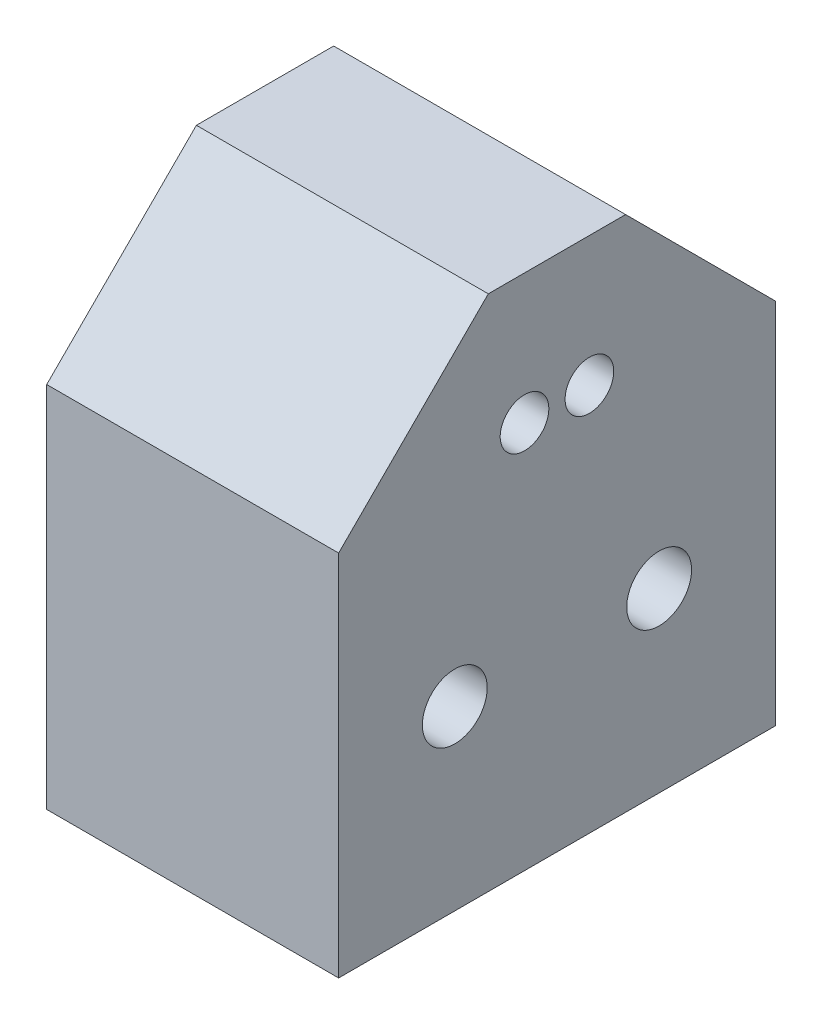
ISO-10303-21;
HEADER;
FILE_DESCRIPTION(('STEP AP214'),'2;1');
FILE_NAME('part.step','',(''),(''),'','','');
FILE_SCHEMA(('AUTOMOTIVE_DESIGN { 1 0 10303 214 1 1 1 1 }'));
ENDSEC;
DATA;
#1=APPLICATION_CONTEXT('core data for automotive mechanical design processes');
#2=APPLICATION_PROTOCOL_DEFINITION('international standard','automotive_design',2000,#1);
#3=PRODUCT_CONTEXT('',#1,'mechanical');
#4=PRODUCT('Part','Part','',(#3));
#5=PRODUCT_RELATED_PRODUCT_CATEGORY('part','',(#4));
#6=PRODUCT_DEFINITION_FORMATION('','',#4);
#7=PRODUCT_DEFINITION_CONTEXT('part definition',#1,'design');
#8=PRODUCT_DEFINITION('design','',#6,#7);
#9=PRODUCT_DEFINITION_SHAPE('','',#8);
#10=(LENGTH_UNIT() NAMED_UNIT(*) SI_UNIT(.MILLI.,.METRE.));
#11=(NAMED_UNIT(*) PLANE_ANGLE_UNIT() SI_UNIT($,.RADIAN.));
#12=(NAMED_UNIT(*) SI_UNIT($,.STERADIAN.) SOLID_ANGLE_UNIT());
#13=UNCERTAINTY_MEASURE_WITH_UNIT(LENGTH_MEASURE(1.E-05),#10,'distance_accuracy_value','');
#14=(GEOMETRIC_REPRESENTATION_CONTEXT(3) GLOBAL_UNCERTAINTY_ASSIGNED_CONTEXT((#13)) GLOBAL_UNIT_ASSIGNED_CONTEXT((#10,
#11,#12)) REPRESENTATION_CONTEXT('',''));
#15=CARTESIAN_POINT('',(0.,0.,0.));
#16=DIRECTION('',(0.,0.,1.));
#17=DIRECTION('',(1.,0.,0.));
#18=AXIS2_PLACEMENT_3D('',#15,#16,#17);
#19=CARTESIAN_POINT('',(18.,13.0798886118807,19.0815166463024));
#20=DIRECTION('',(0.,1.,0.));
#21=DIRECTION('',(0.,0.,1.));
#22=AXIS2_PLACEMENT_3D('',#19,#20,#21);
#23=PLANE('',#22);
#24=DIRECTION('',(0.,0.,-1.));
#25=VECTOR('',#24,1.);
#26=CARTESIAN_POINT('',(0.,13.0798886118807,19.0815166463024));
#27=LINE('',#26,#25);
#28=CARTESIAN_POINT('',(0.,13.0798886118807,19.0815166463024));
#29=VERTEX_POINT('',#28);
#30=CARTESIAN_POINT('',(0.,13.0798886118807,-7.84183435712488));
#31=VERTEX_POINT('',#30);
#32=EDGE_CURVE('E134',#29,#31,#27,.T.);
#33=ORIENTED_EDGE('',*,*,#32,.T.);
#34=DIRECTION('',(-1.,0.,0.));
#35=VECTOR('',#34,1.);
#36=CARTESIAN_POINT('',(18.,13.0798886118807,-7.84183435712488));
#37=LINE('',#36,#35);
#38=CARTESIAN_POINT('',(18.,13.0798886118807,-7.84183435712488));
#39=VERTEX_POINT('',#38);
#40=EDGE_CURVE('E11',#39,#31,#37,.T.);
#41=ORIENTED_EDGE('',*,*,#40,.F.);
#42=DIRECTION('',(0.,0.,-1.));
#43=VECTOR('',#42,1.);
#44=CARTESIAN_POINT('',(18.,13.0798886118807,19.0815166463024));
#45=LINE('',#44,#43);
#46=CARTESIAN_POINT('',(18.,13.0798886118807,19.0815166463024));
#47=VERTEX_POINT('',#46);
#48=EDGE_CURVE('E151',#47,#39,#45,.T.);
#49=ORIENTED_EDGE('',*,*,#48,.F.);
#50=DIRECTION('',(-1.,0.,0.));
#51=VECTOR('',#50,1.);
#52=CARTESIAN_POINT('',(18.,13.0798886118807,19.0815166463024));
#53=LINE('',#52,#51);
#54=EDGE_CURVE('E130',#47,#29,#53,.T.);
#55=ORIENTED_EDGE('',*,*,#54,.T.);
#56=EDGE_LOOP('',(#33,#41,#49,#55));
#57=FACE_BOUND('',#56,.T.);
#58=ADVANCED_FACE('F45',(#57),#23,.F.);
#59=CARTESIAN_POINT('',(18.,35.7715245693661,-7.84183435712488));
#60=DIRECTION('',(0.,0.,1.));
#61=DIRECTION('',(1.,0.,0.));
#62=AXIS2_PLACEMENT_3D('',#59,#60,#61);
#63=PLANE('',#62);
#64=DIRECTION('',(0.,1.,0.));
#65=VECTOR('',#64,1.);
#66=CARTESIAN_POINT('',(0.,35.7715245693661,-7.84183435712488));
#67=LINE('',#66,#65);
#68=CARTESIAN_POINT('',(0.,35.7715245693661,-7.84183435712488));
#69=VERTEX_POINT('',#68);
#70=EDGE_CURVE('E138',#31,#69,#67,.T.);
#71=ORIENTED_EDGE('',*,*,#70,.T.);
#72=DIRECTION('',(-1.,0.,0.));
#73=VECTOR('',#72,1.);
#74=CARTESIAN_POINT('',(18.,35.7715245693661,-7.84183435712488));
#75=LINE('',#74,#73);
#76=CARTESIAN_POINT('',(18.,35.7715245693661,-7.84183435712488));
#77=VERTEX_POINT('',#76);
#78=EDGE_CURVE('E54',#77,#69,#75,.T.);
#79=ORIENTED_EDGE('',*,*,#78,.F.);
#80=DIRECTION('',(0.,1.,0.));
#81=VECTOR('',#80,1.);
#82=CARTESIAN_POINT('',(18.,35.7715245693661,-7.84183435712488));
#83=LINE('',#82,#81);
#84=EDGE_CURVE('E99',#39,#77,#83,.T.);
#85=ORIENTED_EDGE('',*,*,#84,.F.);
#86=ORIENTED_EDGE('',*,*,#40,.T.);
#87=EDGE_LOOP('',(#71,#79,#85,#86));
#88=FACE_BOUND('',#87,.T.);
#89=ADVANCED_FACE('F180',(#88),#63,.F.);
#90=CARTESIAN_POINT('',(18.,45.,1.38664107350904));
#91=DIRECTION('',(0.,-0.707106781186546,0.707106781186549));
#92=DIRECTION('',(0.,-0.707106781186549,-0.707106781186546));
#93=AXIS2_PLACEMENT_3D('',#90,#91,#92);
#94=PLANE('',#93);
#95=DIRECTION('',(0.,0.707106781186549,0.707106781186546));
#96=VECTOR('',#95,1.);
#97=CARTESIAN_POINT('',(0.,45.,1.38664107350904));
#98=LINE('',#97,#96);
#99=CARTESIAN_POINT('',(0.,45.,1.38664107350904));
#100=VERTEX_POINT('',#99);
#101=EDGE_CURVE('E142',#69,#100,#98,.T.);
#102=ORIENTED_EDGE('',*,*,#101,.T.);
#103=DIRECTION('',(-1.,0.,0.));
#104=VECTOR('',#103,1.);
#105=CARTESIAN_POINT('',(18.,45.,1.38664107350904));
#106=LINE('',#105,#104);
#107=CARTESIAN_POINT('',(18.,45.,1.38664107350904));
#108=VERTEX_POINT('',#107);
#109=EDGE_CURVE('E123',#108,#100,#106,.T.);
#110=ORIENTED_EDGE('',*,*,#109,.F.);
#111=DIRECTION('',(0.,0.707106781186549,0.707106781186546));
#112=VECTOR('',#111,1.);
#113=CARTESIAN_POINT('',(18.,45.,1.38664107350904));
#114=LINE('',#113,#112);
#115=EDGE_CURVE('E112',#77,#108,#114,.T.);
#116=ORIENTED_EDGE('',*,*,#115,.F.);
#117=ORIENTED_EDGE('',*,*,#78,.T.);
#118=EDGE_LOOP('',(#102,#110,#116,#117));
#119=FACE_BOUND('',#118,.T.);
#120=ADVANCED_FACE('F161',(#119),#94,.F.);
#121=CARTESIAN_POINT('',(18.,45.,9.85304121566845));
#122=DIRECTION('',(0.,-1.,0.));
#123=DIRECTION('',(0.,0.,-1.));
#124=AXIS2_PLACEMENT_3D('',#121,#122,#123);
#125=PLANE('',#124);
#126=DIRECTION('',(0.,0.,1.));
#127=VECTOR('',#126,1.);
#128=CARTESIAN_POINT('',(0.,45.,9.85304121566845));
#129=LINE('',#128,#127);
#130=CARTESIAN_POINT('',(0.,45.,9.85304121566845));
#131=VERTEX_POINT('',#130);
#132=EDGE_CURVE('E121',#100,#131,#129,.T.);
#133=ORIENTED_EDGE('',*,*,#132,.T.);
#134=DIRECTION('',(-1.,0.,0.));
#135=VECTOR('',#134,1.);
#136=CARTESIAN_POINT('',(18.,45.,9.85304121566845));
#137=LINE('',#136,#135);
#138=CARTESIAN_POINT('',(18.,45.,9.85304121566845));
#139=VERTEX_POINT('',#138);
#140=EDGE_CURVE('E118',#139,#131,#137,.T.);
#141=ORIENTED_EDGE('',*,*,#140,.F.);
#142=DIRECTION('',(0.,0.,1.));
#143=VECTOR('',#142,1.);
#144=CARTESIAN_POINT('',(18.,45.,9.85304121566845));
#145=LINE('',#144,#143);
#146=EDGE_CURVE('E106',#108,#139,#145,.T.);
#147=ORIENTED_EDGE('',*,*,#146,.F.);
#148=ORIENTED_EDGE('',*,*,#109,.T.);
#149=EDGE_LOOP('',(#133,#141,#147,#148));
#150=FACE_BOUND('',#149,.T.);
#151=ADVANCED_FACE('F119',(#150),#125,.F.);
#152=CARTESIAN_POINT('',(18.,35.7715245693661,19.0815166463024));
#153=DIRECTION('',(0.,-0.707106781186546,-0.707106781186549));
#154=DIRECTION('',(0.,0.707106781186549,-0.707106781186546));
#155=AXIS2_PLACEMENT_3D('',#152,#153,#154);
#156=PLANE('',#155);
#157=DIRECTION('',(0.,-0.707106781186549,0.707106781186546));
#158=VECTOR('',#157,1.);
#159=CARTESIAN_POINT('',(0.,35.7715245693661,19.0815166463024));
#160=LINE('',#159,#158);
#161=CARTESIAN_POINT('',(0.,35.7715245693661,19.0815166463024));
#162=VERTEX_POINT('',#161);
#163=EDGE_CURVE('E85',#131,#162,#160,.T.);
#164=ORIENTED_EDGE('',*,*,#163,.T.);
#165=DIRECTION('',(-1.,0.,0.));
#166=VECTOR('',#165,1.);
#167=CARTESIAN_POINT('',(18.,35.7715245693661,19.0815166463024));
#168=LINE('',#167,#166);
#169=CARTESIAN_POINT('',(18.,35.7715245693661,19.0815166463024));
#170=VERTEX_POINT('',#169);
#171=EDGE_CURVE('E124',#170,#162,#168,.T.);
#172=ORIENTED_EDGE('',*,*,#171,.F.);
#173=DIRECTION('',(0.,-0.707106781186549,0.707106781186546));
#174=VECTOR('',#173,1.);
#175=CARTESIAN_POINT('',(18.,35.7715245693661,19.0815166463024));
#176=LINE('',#175,#174);
#177=EDGE_CURVE('E110',#139,#170,#176,.T.);
#178=ORIENTED_EDGE('',*,*,#177,.F.);
#179=ORIENTED_EDGE('',*,*,#140,.T.);
#180=EDGE_LOOP('',(#164,#172,#178,#179));
#181=FACE_BOUND('',#180,.T.);
#182=ADVANCED_FACE('F126',(#181),#156,.F.);
#183=CARTESIAN_POINT('',(18.,35.7715245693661,19.0815166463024));
#184=DIRECTION('',(0.,0.,-1.));
#185=DIRECTION('',(-1.,0.,0.));
#186=AXIS2_PLACEMENT_3D('',#183,#184,#185);
#187=PLANE('',#186);
#188=DIRECTION('',(0.,-1.,0.));
#189=VECTOR('',#188,1.);
#190=CARTESIAN_POINT('',(0.,35.7715245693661,19.0815166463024));
#191=LINE('',#190,#189);
#192=EDGE_CURVE('E91',#162,#29,#191,.T.);
#193=ORIENTED_EDGE('',*,*,#192,.T.);
#194=ORIENTED_EDGE('',*,*,#54,.F.);
#195=DIRECTION('',(0.,-1.,0.));
#196=VECTOR('',#195,1.);
#197=CARTESIAN_POINT('',(18.,35.7715245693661,19.0815166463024));
#198=LINE('',#197,#196);
#199=EDGE_CURVE('E62',#170,#47,#198,.T.);
#200=ORIENTED_EDGE('',*,*,#199,.F.);
#201=ORIENTED_EDGE('',*,*,#171,.T.);
#202=EDGE_LOOP('',(#193,#194,#200,#201));
#203=FACE_BOUND('',#202,.T.);
#204=ADVANCED_FACE('F168',(#203),#187,.F.);
#205=CARTESIAN_POINT('',(18.,0.,0.));
#206=DIRECTION('',(-1.,0.,0.));
#207=DIRECTION('',(0.,0.,1.));
#208=AXIS2_PLACEMENT_3D('',#205,#206,#207);
#209=PLANE('',#208);
#210=CARTESIAN_POINT('',(18.,24.,-0.680158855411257));
#211=DIRECTION('',(1.,0.,0.));
#212=DIRECTION('',(0.,0.,-1.));
#213=AXIS2_PLACEMENT_3D('',#210,#211,#212);
#214=CIRCLE('',#213,2.);
#215=CARTESIAN_POINT('',(18.,24.,-2.68015885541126));
#216=VERTEX_POINT('',#215);
#217=EDGE_CURVE('E266',#216,#216,#214,.T.);
#218=ORIENTED_EDGE('',*,*,#217,.F.);
#219=EDGE_LOOP('',(#218));
#220=FACE_BOUND('',#219,.T.);
#221=CARTESIAN_POINT('',(18.,37.,7.61984114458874));
#222=DIRECTION('',(1.,0.,0.));
#223=DIRECTION('',(0.,0.,-1.));
#224=AXIS2_PLACEMENT_3D('',#221,#222,#223);
#225=CIRCLE('',#224,1.5);
#226=CARTESIAN_POINT('',(18.,37.,6.11984114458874));
#227=VERTEX_POINT('',#226);
#228=EDGE_CURVE('E268',#227,#227,#225,.T.);
#229=ORIENTED_EDGE('',*,*,#228,.F.);
#230=EDGE_LOOP('',(#229));
#231=FACE_BOUND('',#230,.T.);
#232=CARTESIAN_POINT('',(18.,37.,3.61984114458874));
#233=DIRECTION('',(1.,0.,0.));
#234=DIRECTION('',(0.,0.,-1.));
#235=AXIS2_PLACEMENT_3D('',#232,#233,#234);
#236=CIRCLE('',#235,1.5);
#237=CARTESIAN_POINT('',(18.,37.,2.11984114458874));
#238=VERTEX_POINT('',#237);
#239=EDGE_CURVE('E280',#238,#238,#236,.T.);
#240=ORIENTED_EDGE('',*,*,#239,.F.);
#241=EDGE_LOOP('',(#240));
#242=FACE_BOUND('',#241,.T.);
#243=CARTESIAN_POINT('',(18.,24.,11.9198411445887));
#244=DIRECTION('',(1.,0.,0.));
#245=DIRECTION('',(0.,0.,-1.));
#246=AXIS2_PLACEMENT_3D('',#243,#244,#245);
#247=CIRCLE('',#246,2.00000000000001);
#248=CARTESIAN_POINT('',(18.,24.,9.91984114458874));
#249=VERTEX_POINT('',#248);
#250=EDGE_CURVE('E288',#249,#249,#247,.T.);
#251=ORIENTED_EDGE('',*,*,#250,.F.);
#252=EDGE_LOOP('',(#251));
#253=FACE_BOUND('',#252,.T.);
#254=ORIENTED_EDGE('',*,*,#48,.T.);
#255=ORIENTED_EDGE('',*,*,#84,.T.);
#256=ORIENTED_EDGE('',*,*,#115,.T.);
#257=ORIENTED_EDGE('',*,*,#146,.T.);
#258=ORIENTED_EDGE('',*,*,#177,.T.);
#259=ORIENTED_EDGE('',*,*,#199,.T.);
#260=EDGE_LOOP('',(#254,#255,#256,#257,#258,#259));
#261=FACE_BOUND('',#260,.T.);
#262=ADVANCED_FACE('F108',(#220,#231,#242,#253,#261),#209,.F.);
#263=CARTESIAN_POINT('',(0.,0.,0.));
#264=DIRECTION('',(-1.,0.,0.));
#265=DIRECTION('',(0.,0.,1.));
#266=AXIS2_PLACEMENT_3D('',#263,#264,#265);
#267=PLANE('',#266);
#268=CARTESIAN_POINT('',(0.,24.,-0.680158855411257));
#269=DIRECTION('',(1.,0.,0.));
#270=DIRECTION('',(0.,0.,-1.));
#271=AXIS2_PLACEMENT_3D('',#268,#269,#270);
#272=CIRCLE('',#271,2.);
#273=CARTESIAN_POINT('',(0.,24.,-2.68015885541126));
#274=VERTEX_POINT('',#273);
#275=EDGE_CURVE('E139',#274,#274,#272,.T.);
#276=ORIENTED_EDGE('',*,*,#275,.T.);
#277=EDGE_LOOP('',(#276));
#278=FACE_BOUND('',#277,.T.);
#279=CARTESIAN_POINT('',(0.,37.,7.61984114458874));
#280=DIRECTION('',(1.,0.,0.));
#281=DIRECTION('',(0.,0.,-1.));
#282=AXIS2_PLACEMENT_3D('',#279,#280,#281);
#283=CIRCLE('',#282,1.5);
#284=CARTESIAN_POINT('',(0.,37.,6.11984114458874));
#285=VERTEX_POINT('',#284);
#286=EDGE_CURVE('E274',#285,#285,#283,.T.);
#287=ORIENTED_EDGE('',*,*,#286,.T.);
#288=EDGE_LOOP('',(#287));
#289=FACE_BOUND('',#288,.T.);
#290=CARTESIAN_POINT('',(0.,37.,3.61984114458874));
#291=DIRECTION('',(1.,0.,0.));
#292=DIRECTION('',(0.,0.,-1.));
#293=AXIS2_PLACEMENT_3D('',#290,#291,#292);
#294=CIRCLE('',#293,1.5);
#295=CARTESIAN_POINT('',(0.,37.,2.11984114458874));
#296=VERTEX_POINT('',#295);
#297=EDGE_CURVE('E284',#296,#296,#294,.T.);
#298=ORIENTED_EDGE('',*,*,#297,.T.);
#299=EDGE_LOOP('',(#298));
#300=FACE_BOUND('',#299,.T.);
#301=CARTESIAN_POINT('',(0.,24.,11.9198411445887));
#302=DIRECTION('',(1.,0.,0.));
#303=DIRECTION('',(0.,0.,-1.));
#304=AXIS2_PLACEMENT_3D('',#301,#302,#303);
#305=CIRCLE('',#304,2.00000000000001);
#306=CARTESIAN_POINT('',(0.,24.,9.91984114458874));
#307=VERTEX_POINT('',#306);
#308=EDGE_CURVE('E292',#307,#307,#305,.T.);
#309=ORIENTED_EDGE('',*,*,#308,.T.);
#310=EDGE_LOOP('',(#309));
#311=FACE_BOUND('',#310,.T.);
#312=ORIENTED_EDGE('',*,*,#32,.F.);
#313=ORIENTED_EDGE('',*,*,#192,.F.);
#314=ORIENTED_EDGE('',*,*,#163,.F.);
#315=ORIENTED_EDGE('',*,*,#132,.F.);
#316=ORIENTED_EDGE('',*,*,#101,.F.);
#317=ORIENTED_EDGE('',*,*,#70,.F.);
#318=EDGE_LOOP('',(#312,#313,#314,#315,#316,#317));
#319=FACE_BOUND('',#318,.T.);
#320=ADVANCED_FACE('F164',(#278,#289,#300,#311,#319),#267,.T.);
#321=CARTESIAN_POINT('',(0.,24.,11.9198411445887));
#322=DIRECTION('',(1.,0.,0.));
#323=DIRECTION('',(0.,0.,-1.));
#324=AXIS2_PLACEMENT_3D('',#321,#322,#323);
#325=CYLINDRICAL_SURFACE('',#324,2.00000000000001);
#326=ORIENTED_EDGE('',*,*,#308,.F.);
#327=EDGE_LOOP('',(#326));
#328=FACE_BOUND('',#327,.T.);
#329=ORIENTED_EDGE('',*,*,#250,.T.);
#330=EDGE_LOOP('',(#329));
#331=FACE_BOUND('',#330,.T.);
#332=ADVANCED_FACE('F219',(#328,#331),#325,.F.);
#333=CARTESIAN_POINT('',(0.,37.,3.61984114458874));
#334=DIRECTION('',(1.,0.,0.));
#335=DIRECTION('',(0.,0.,-1.));
#336=AXIS2_PLACEMENT_3D('',#333,#334,#335);
#337=CYLINDRICAL_SURFACE('',#336,1.5);
#338=ORIENTED_EDGE('',*,*,#297,.F.);
#339=EDGE_LOOP('',(#338));
#340=FACE_BOUND('',#339,.T.);
#341=ORIENTED_EDGE('',*,*,#239,.T.);
#342=EDGE_LOOP('',(#341));
#343=FACE_BOUND('',#342,.T.);
#344=ADVANCED_FACE('F228',(#340,#343),#337,.F.);
#345=CARTESIAN_POINT('',(0.,37.,7.61984114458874));
#346=DIRECTION('',(1.,0.,0.));
#347=DIRECTION('',(0.,0.,-1.));
#348=AXIS2_PLACEMENT_3D('',#345,#346,#347);
#349=CYLINDRICAL_SURFACE('',#348,1.5);
#350=ORIENTED_EDGE('',*,*,#286,.F.);
#351=EDGE_LOOP('',(#350));
#352=FACE_BOUND('',#351,.T.);
#353=ORIENTED_EDGE('',*,*,#228,.T.);
#354=EDGE_LOOP('',(#353));
#355=FACE_BOUND('',#354,.T.);
#356=ADVANCED_FACE('F238',(#352,#355),#349,.F.);
#357=CARTESIAN_POINT('',(0.,24.,-0.680158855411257));
#358=DIRECTION('',(1.,0.,0.));
#359=DIRECTION('',(0.,0.,-1.));
#360=AXIS2_PLACEMENT_3D('',#357,#358,#359);
#361=CYLINDRICAL_SURFACE('',#360,2.);
#362=ORIENTED_EDGE('',*,*,#275,.F.);
#363=EDGE_LOOP('',(#362));
#364=FACE_BOUND('',#363,.T.);
#365=ORIENTED_EDGE('',*,*,#217,.T.);
#366=EDGE_LOOP('',(#365));
#367=FACE_BOUND('',#366,.T.);
#368=ADVANCED_FACE('F248',(#364,#367),#361,.F.);
#369=CLOSED_SHELL('',(#58,#89,#120,#151,#182,#204,#262,#320,#332,#344,#356,#368));
#370=MANIFOLD_SOLID_BREP('B2',#369);
#371=ADVANCED_BREP_SHAPE_REPRESENTATION('',(#18,#370),#14);
#372=SHAPE_DEFINITION_REPRESENTATION(#9,#371);
ENDSEC;
END-ISO-10303-21;
